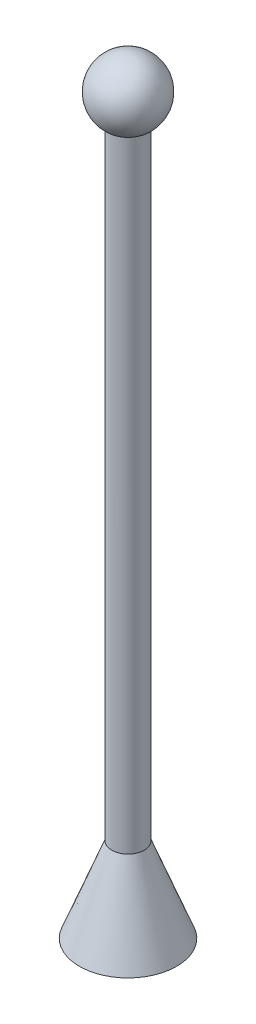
from build123d import *

# Parameters (mm, degrees)
SKETCH2_R           = 6.35
SKETCH1_R           = 19.05
SKETCH3_R           = 6.35
BOSS_EXTRUDE1_DEPTH = 254


with BuildPart() as part:
    # Sketch2 → Loft1 section 0
    with BuildSketch(Plane(origin=(0, 33.02, 0), x_dir=(-1, 0, 0), z_dir=(0, 1, 0))):
        Circle(SKETCH2_R)
    # Sketch1 → Loft1 section 1
    with BuildSketch(Plane(origin=(0, 0, 0), x_dir=(1, 0, 0), z_dir=(0, 1, 0))):
        Circle(SKETCH1_R)
    loft()

    # Sketch3 → Boss-Extrude1 (add)
    with BuildSketch(Plane(origin=(0, 33.02, 0), x_dir=(1, 0, 0), z_dir=(0, 1, 0))):
        with Locations(Location((0, 0, 0), (0, 0, 90))):
            Circle(SKETCH3_R)
    extrude(amount=BOSS_EXTRUDE1_DEPTH)

    # Sketch4 → Revolve1 (revolve)
    with BuildSketch(Plane.XY):
        with BuildLine():
            Line((0, 299.72), (0, 274.32))
            ThreePointArc((0, 274.32), (-12.7, 287.02), (0, 299.72))
        make_face()
    revolve(axis=Axis((0, 299.72, 0), (0, -1, 0)))


solid = part.part
